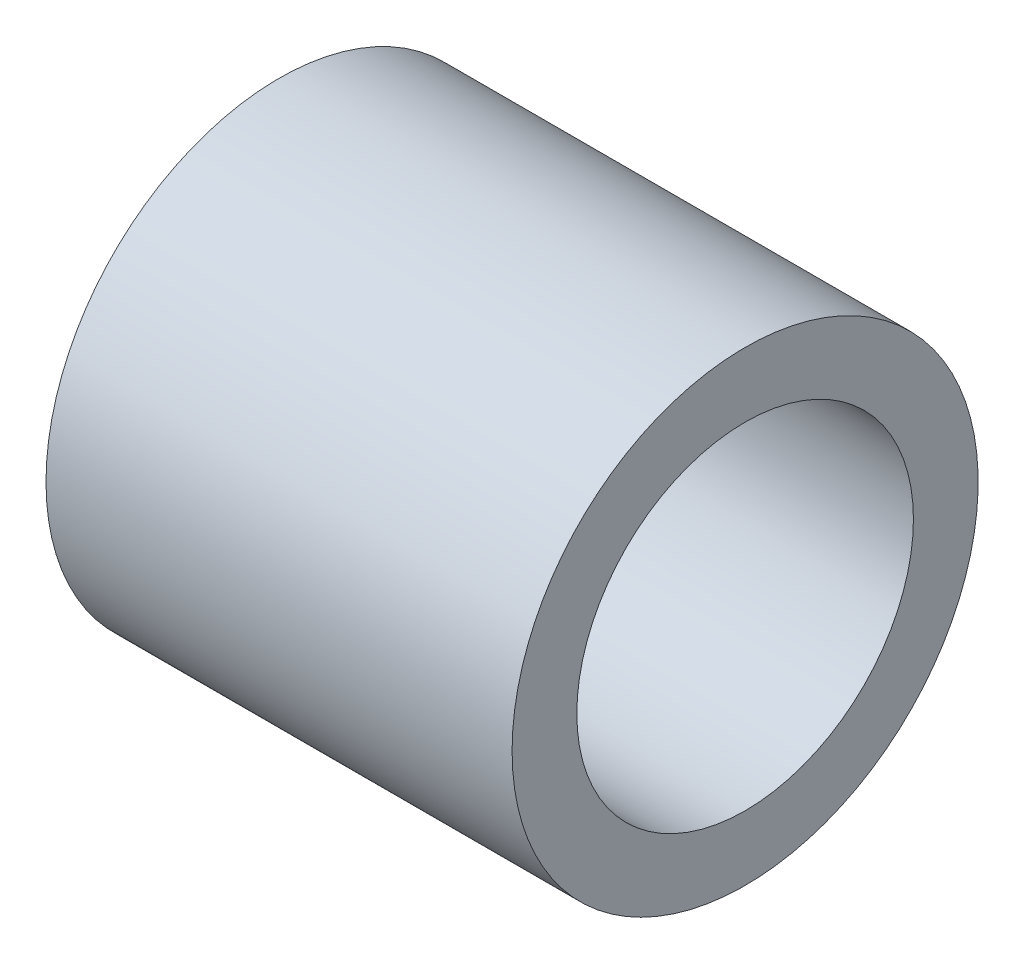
ISO-10303-21;
HEADER;
FILE_DESCRIPTION(('STEP AP214'),'2;1');
FILE_NAME('part.step','',(''),(''),'','','');
FILE_SCHEMA(('AUTOMOTIVE_DESIGN { 1 0 10303 214 1 1 1 1 }'));
ENDSEC;
DATA;
#1=APPLICATION_CONTEXT('core data for automotive mechanical design processes');
#2=APPLICATION_PROTOCOL_DEFINITION('international standard','automotive_design',2000,#1);
#3=PRODUCT_CONTEXT('',#1,'mechanical');
#4=PRODUCT('Part','Part','',(#3));
#5=PRODUCT_RELATED_PRODUCT_CATEGORY('part','',(#4));
#6=PRODUCT_DEFINITION_FORMATION('','',#4);
#7=PRODUCT_DEFINITION_CONTEXT('part definition',#1,'design');
#8=PRODUCT_DEFINITION('design','',#6,#7);
#9=PRODUCT_DEFINITION_SHAPE('','',#8);
#10=(LENGTH_UNIT() NAMED_UNIT(*) SI_UNIT(.MILLI.,.METRE.));
#11=(NAMED_UNIT(*) PLANE_ANGLE_UNIT() SI_UNIT($,.RADIAN.));
#12=(NAMED_UNIT(*) SI_UNIT($,.STERADIAN.) SOLID_ANGLE_UNIT());
#13=UNCERTAINTY_MEASURE_WITH_UNIT(LENGTH_MEASURE(1.E-05),#10,'distance_accuracy_value','');
#14=(GEOMETRIC_REPRESENTATION_CONTEXT(3) GLOBAL_UNCERTAINTY_ASSIGNED_CONTEXT((#13)) GLOBAL_UNIT_ASSIGNED_CONTEXT((#10,
#11,#12)) REPRESENTATION_CONTEXT('',''));
#15=CARTESIAN_POINT('',(0.,0.,0.));
#16=DIRECTION('',(0.,0.,1.));
#17=DIRECTION('',(1.,0.,0.));
#18=AXIS2_PLACEMENT_3D('',#15,#16,#17);
#19=CARTESIAN_POINT('',(9.,4.5,0.));
#20=DIRECTION('',(-1.,0.,0.));
#21=DIRECTION('',(0.,0.,1.));
#22=AXIS2_PLACEMENT_3D('',#19,#20,#21);
#23=PLANE('',#22);
#24=CARTESIAN_POINT('',(9.,0.,0.));
#25=DIRECTION('',(-1.,0.,0.));
#26=DIRECTION('',(0.,0.,1.));
#27=AXIS2_PLACEMENT_3D('',#24,#25,#26);
#28=CIRCLE('',#27,4.5);
#29=CARTESIAN_POINT('',(9.,0.,4.5));
#30=VERTEX_POINT('',#29);
#31=EDGE_CURVE('E10',#30,#30,#28,.T.);
#32=ORIENTED_EDGE('',*,*,#31,.F.);
#33=EDGE_LOOP('',(#32));
#34=FACE_BOUND('',#33,.T.);
#35=CARTESIAN_POINT('',(9.,0.,0.));
#36=DIRECTION('',(-1.,0.,0.));
#37=DIRECTION('',(0.,0.,1.));
#38=AXIS2_PLACEMENT_3D('',#35,#36,#37);
#39=CIRCLE('',#38,3.25);
#40=CARTESIAN_POINT('',(9.,0.,3.25));
#41=VERTEX_POINT('',#40);
#42=EDGE_CURVE('E41',#41,#41,#39,.T.);
#43=ORIENTED_EDGE('',*,*,#42,.T.);
#44=EDGE_LOOP('',(#43));
#45=FACE_BOUND('',#44,.T.);
#46=ADVANCED_FACE('F31',(#34,#45),#23,.F.);
#47=CARTESIAN_POINT('',(0.,4.5,0.));
#48=DIRECTION('',(1.,0.,0.));
#49=DIRECTION('',(0.,0.,-1.));
#50=AXIS2_PLACEMENT_3D('',#47,#48,#49);
#51=PLANE('',#50);
#52=CARTESIAN_POINT('',(0.,0.,0.));
#53=DIRECTION('',(-1.,0.,0.));
#54=DIRECTION('',(0.,0.,1.));
#55=AXIS2_PLACEMENT_3D('',#52,#53,#54);
#56=CIRCLE('',#55,4.5);
#57=CARTESIAN_POINT('',(0.,0.,4.5));
#58=VERTEX_POINT('',#57);
#59=EDGE_CURVE('E37',#58,#58,#56,.T.);
#60=ORIENTED_EDGE('',*,*,#59,.T.);
#61=EDGE_LOOP('',(#60));
#62=FACE_BOUND('',#61,.T.);
#63=CARTESIAN_POINT('',(0.,0.,0.));
#64=DIRECTION('',(-1.,0.,0.));
#65=DIRECTION('',(0.,0.,1.));
#66=AXIS2_PLACEMENT_3D('',#63,#64,#65);
#67=CIRCLE('',#66,3.25);
#68=CARTESIAN_POINT('',(0.,0.,3.25));
#69=VERTEX_POINT('',#68);
#70=EDGE_CURVE('E45',#69,#69,#67,.T.);
#71=ORIENTED_EDGE('',*,*,#70,.F.);
#72=EDGE_LOOP('',(#71));
#73=FACE_BOUND('',#72,.T.);
#74=ADVANCED_FACE('F54',(#62,#73),#51,.F.);
#75=CARTESIAN_POINT('',(0.,0.,0.));
#76=DIRECTION('',(-1.,0.,0.));
#77=DIRECTION('',(0.,0.,1.));
#78=AXIS2_PLACEMENT_3D('',#75,#76,#77);
#79=CYLINDRICAL_SURFACE('',#78,4.5);
#80=ORIENTED_EDGE('',*,*,#59,.F.);
#81=EDGE_LOOP('',(#80));
#82=FACE_BOUND('',#81,.T.);
#83=ORIENTED_EDGE('',*,*,#31,.T.);
#84=EDGE_LOOP('',(#83));
#85=FACE_BOUND('',#84,.T.);
#86=ADVANCED_FACE('F56',(#82,#85),#79,.T.);
#87=CARTESIAN_POINT('',(0.,0.,0.));
#88=DIRECTION('',(-1.,0.,0.));
#89=DIRECTION('',(0.,0.,1.));
#90=AXIS2_PLACEMENT_3D('',#87,#88,#89);
#91=CYLINDRICAL_SURFACE('',#90,3.25);
#92=ORIENTED_EDGE('',*,*,#70,.T.);
#93=EDGE_LOOP('',(#92));
#94=FACE_BOUND('',#93,.T.);
#95=ORIENTED_EDGE('',*,*,#42,.F.);
#96=EDGE_LOOP('',(#95));
#97=FACE_BOUND('',#96,.T.);
#98=ADVANCED_FACE('F51',(#94,#97),#91,.F.);
#99=CLOSED_SHELL('',(#46,#74,#86,#98));
#100=MANIFOLD_SOLID_BREP('B2',#99);
#101=ADVANCED_BREP_SHAPE_REPRESENTATION('',(#18,#100),#14);
#102=SHAPE_DEFINITION_REPRESENTATION(#9,#101);
ENDSEC;
END-ISO-10303-21;
